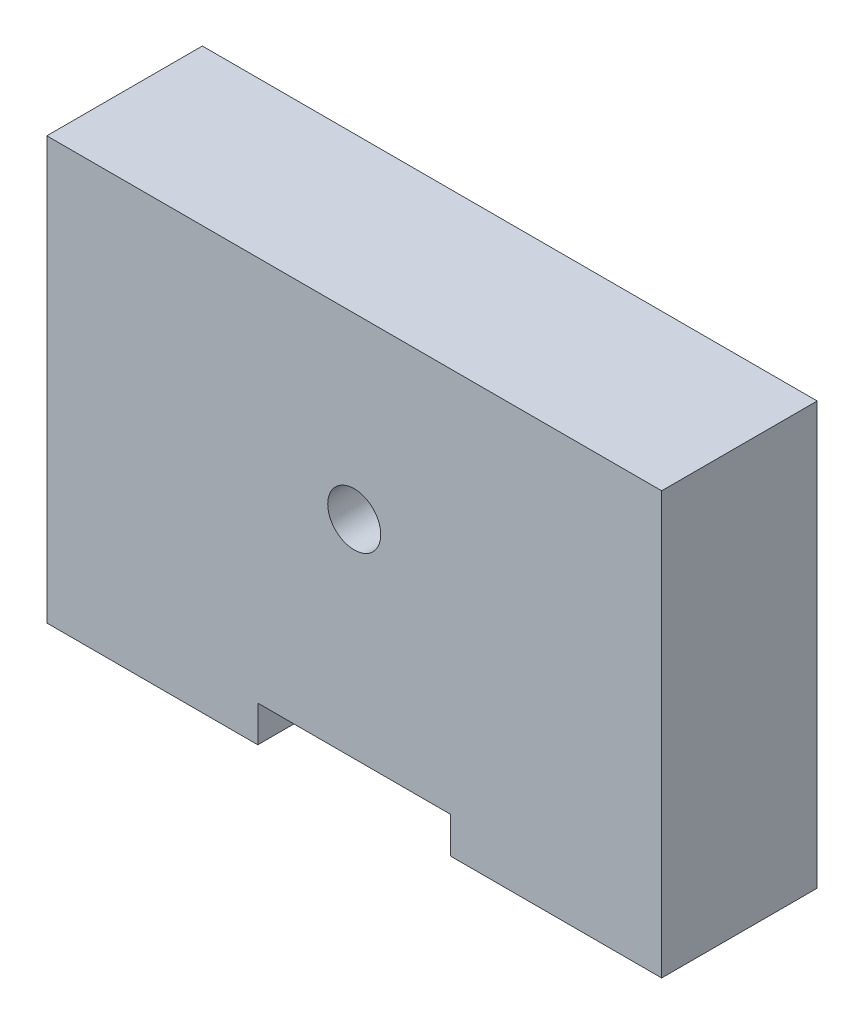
from build123d import *

# Parameters (mm, degrees)
SKETCH2_W                 = 51
SKETCH2_H                 = 12.9
BOSS_EXTRUDE1_DEPTH       = 35
M5X0_8_TAPPED_HOLE1_D     = 4.2
M5X0_8_TAPPED_HOLE1_DEPTH = 12.4
M5X0_8_TAPPED_HOLE1_TIP   = 1.2618073
SKETCH5_R                 = 2.2
SKETCH5_W                 = 16
SKETCH5_H                 = 3
CUT_EXTRUDE1_DEPTH        = 12.9


with BuildPart() as part:
    # Sketch2 → Boss-Extrude1 (new body)
    with BuildSketch(Plane(origin=(0, 0, 0), x_dir=(1, 0, 0), z_dir=(0, 1, 0))):
        Rectangle(SKETCH2_W, SKETCH2_H)
    extrude(amount=BOSS_EXTRUDE1_DEPTH)

    # M5x0.8 Tapped Hole1
    with Locations(Plane(origin=(0, 0, 0), x_dir=(-1, 0, 0), z_dir=(0, -1, 0))):
        with Locations((-18.75, 0), (18.75, 0)):
            Hole(M5X0_8_TAPPED_HOLE1_D / 2, depth=M5X0_8_TAPPED_HOLE1_DEPTH)
            with Locations((0, 0, -(M5X0_8_TAPPED_HOLE1_DEPTH + M5X0_8_TAPPED_HOLE1_TIP / 2))):  # 118° drill point
                Cone(0, M5X0_8_TAPPED_HOLE1_D / 2, M5X0_8_TAPPED_HOLE1_TIP, mode=Mode.SUBTRACT)

    # Sketch5 → Cut-Extrude1 (cut)
    with BuildSketch(Plane(origin=(0, 0, -6.45), x_dir=(-1, 0, 0), z_dir=(0, 0, -1))):
        with Locations((0, 20.2)):
            Circle(SKETCH5_R)
        with Locations((0, 1.5)):
            Rectangle(SKETCH5_W, SKETCH5_H)
    extrude(amount=-CUT_EXTRUDE1_DEPTH, mode=Mode.SUBTRACT)


solid = part.part
